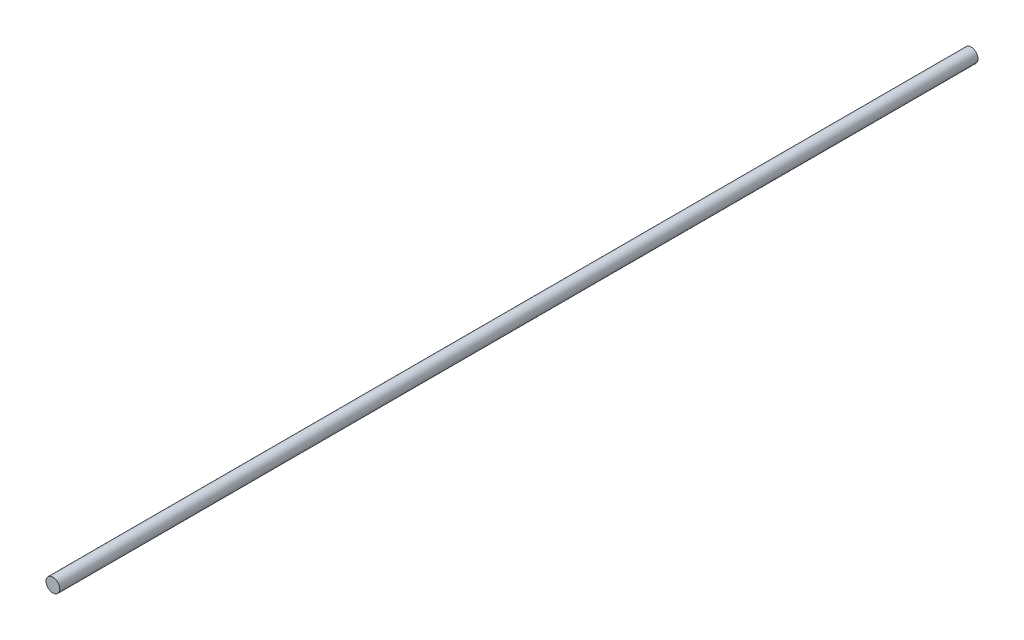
ISO-10303-21;
HEADER;
FILE_DESCRIPTION(('STEP AP214'),'2;1');
FILE_NAME('part.step','',(''),(''),'','','');
FILE_SCHEMA(('AUTOMOTIVE_DESIGN { 1 0 10303 214 1 1 1 1 }'));
ENDSEC;
DATA;
#1=APPLICATION_CONTEXT('core data for automotive mechanical design processes');
#2=APPLICATION_PROTOCOL_DEFINITION('international standard','automotive_design',2000,#1);
#3=PRODUCT_CONTEXT('',#1,'mechanical');
#4=PRODUCT('Part','Part','',(#3));
#5=PRODUCT_RELATED_PRODUCT_CATEGORY('part','',(#4));
#6=PRODUCT_DEFINITION_FORMATION('','',#4);
#7=PRODUCT_DEFINITION_CONTEXT('part definition',#1,'design');
#8=PRODUCT_DEFINITION('design','',#6,#7);
#9=PRODUCT_DEFINITION_SHAPE('','',#8);
#10=(LENGTH_UNIT() NAMED_UNIT(*) SI_UNIT(.MILLI.,.METRE.));
#11=(NAMED_UNIT(*) PLANE_ANGLE_UNIT() SI_UNIT($,.RADIAN.));
#12=(NAMED_UNIT(*) SI_UNIT($,.STERADIAN.) SOLID_ANGLE_UNIT());
#13=UNCERTAINTY_MEASURE_WITH_UNIT(LENGTH_MEASURE(1.E-05),#10,'distance_accuracy_value','');
#14=(GEOMETRIC_REPRESENTATION_CONTEXT(3) GLOBAL_UNCERTAINTY_ASSIGNED_CONTEXT((#13)) GLOBAL_UNIT_ASSIGNED_CONTEXT((#10,
#11,#12)) REPRESENTATION_CONTEXT('',''));
#15=CARTESIAN_POINT('',(0.,0.,0.));
#16=DIRECTION('',(0.,0.,1.));
#17=DIRECTION('',(1.,0.,0.));
#18=AXIS2_PLACEMENT_3D('',#15,#16,#17);
#19=CARTESIAN_POINT('',(0.,0.,635.));
#20=DIRECTION('',(0.,0.,-1.));
#21=DIRECTION('',(-1.,0.,0.));
#22=AXIS2_PLACEMENT_3D('',#19,#20,#21);
#23=CYLINDRICAL_SURFACE('',#22,4.7625);
#24=CARTESIAN_POINT('',(0.,0.,635.));
#25=DIRECTION('',(0.,0.,1.));
#26=DIRECTION('',(1.,0.,0.));
#27=AXIS2_PLACEMENT_3D('',#24,#25,#26);
#28=CIRCLE('',#27,4.7625);
#29=CARTESIAN_POINT('',(-4.7625,0.,635.));
#30=VERTEX_POINT('',#29);
#31=EDGE_CURVE('E10',#30,#30,#28,.T.);
#32=CARTESIAN_POINT('',(0.,0.,0.));
#33=DIRECTION('',(0.,0.,1.));
#34=DIRECTION('',(1.,0.,0.));
#35=AXIS2_PLACEMENT_3D('',#32,#33,#34);
#36=CIRCLE('',#35,4.7625);
#37=CARTESIAN_POINT('',(-4.7625,0.,-1.11022302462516E-13));
#38=VERTEX_POINT('',#37);
#39=EDGE_CURVE('E36',#38,#38,#36,.T.);
#40=CARTESIAN_POINT('',(-4.7625,0.,635.));
#41=CARTESIAN_POINT('',(-4.7625,0.,628.385416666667));
#42=CARTESIAN_POINT('',(-4.7625,0.,621.770833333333));
#43=CARTESIAN_POINT('',(-4.7625,0.,608.541666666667));
#44=CARTESIAN_POINT('',(-4.7625,0.,601.927083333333));
#45=CARTESIAN_POINT('',(-4.7625,0.,588.697916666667));
#46=CARTESIAN_POINT('',(-4.7625,0.,582.083333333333));
#47=CARTESIAN_POINT('',(-4.7625,0.,568.854166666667));
#48=CARTESIAN_POINT('',(-4.7625,0.,562.239583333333));
#49=CARTESIAN_POINT('',(-4.7625,0.,549.010416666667));
#50=CARTESIAN_POINT('',(-4.7625,0.,542.395833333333));
#51=CARTESIAN_POINT('',(-4.7625,0.,529.166666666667));
#52=CARTESIAN_POINT('',(-4.7625,0.,522.552083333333));
#53=CARTESIAN_POINT('',(-4.7625,0.,509.322916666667));
#54=CARTESIAN_POINT('',(-4.7625,0.,502.708333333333));
#55=CARTESIAN_POINT('',(-4.7625,0.,489.479166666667));
#56=CARTESIAN_POINT('',(-4.7625,0.,482.864583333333));
#57=CARTESIAN_POINT('',(-4.7625,0.,469.635416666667));
#58=CARTESIAN_POINT('',(-4.7625,0.,463.020833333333));
#59=CARTESIAN_POINT('',(-4.7625,0.,449.791666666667));
#60=CARTESIAN_POINT('',(-4.7625,0.,443.177083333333));
#61=CARTESIAN_POINT('',(-4.7625,0.,429.947916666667));
#62=CARTESIAN_POINT('',(-4.7625,0.,423.333333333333));
#63=CARTESIAN_POINT('',(-4.7625,0.,410.104166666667));
#64=CARTESIAN_POINT('',(-4.7625,0.,403.489583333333));
#65=CARTESIAN_POINT('',(-4.7625,0.,390.260416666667));
#66=CARTESIAN_POINT('',(-4.7625,0.,383.645833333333));
#67=CARTESIAN_POINT('',(-4.7625,0.,370.416666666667));
#68=CARTESIAN_POINT('',(-4.7625,0.,363.802083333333));
#69=CARTESIAN_POINT('',(-4.7625,0.,350.572916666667));
#70=CARTESIAN_POINT('',(-4.7625,0.,343.958333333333));
#71=CARTESIAN_POINT('',(-4.7625,0.,330.729166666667));
#72=CARTESIAN_POINT('',(-4.7625,0.,324.114583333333));
#73=CARTESIAN_POINT('',(-4.7625,0.,310.885416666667));
#74=CARTESIAN_POINT('',(-4.7625,0.,304.270833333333));
#75=CARTESIAN_POINT('',(-4.7625,0.,291.041666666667));
#76=CARTESIAN_POINT('',(-4.7625,0.,284.427083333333));
#77=CARTESIAN_POINT('',(-4.7625,0.,271.197916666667));
#78=CARTESIAN_POINT('',(-4.7625,0.,264.583333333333));
#79=CARTESIAN_POINT('',(-4.7625,0.,251.354166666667));
#80=CARTESIAN_POINT('',(-4.7625,0.,244.739583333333));
#81=CARTESIAN_POINT('',(-4.7625,0.,231.510416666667));
#82=CARTESIAN_POINT('',(-4.7625,0.,224.895833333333));
#83=CARTESIAN_POINT('',(-4.7625,0.,211.666666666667));
#84=CARTESIAN_POINT('',(-4.7625,0.,205.052083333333));
#85=CARTESIAN_POINT('',(-4.7625,0.,191.822916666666));
#86=CARTESIAN_POINT('',(-4.7625,0.,185.208333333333));
#87=CARTESIAN_POINT('',(-4.7625,0.,171.979166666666));
#88=CARTESIAN_POINT('',(-4.7625,0.,165.364583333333));
#89=CARTESIAN_POINT('',(-4.7625,0.,152.135416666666));
#90=CARTESIAN_POINT('',(-4.7625,0.,145.520833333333));
#91=CARTESIAN_POINT('',(-4.7625,0.,132.291666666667));
#92=CARTESIAN_POINT('',(-4.7625,0.,125.677083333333));
#93=CARTESIAN_POINT('',(-4.7625,0.,112.447916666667));
#94=CARTESIAN_POINT('',(-4.7625,0.,105.833333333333));
#95=CARTESIAN_POINT('',(-4.7625,0.,92.6041666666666));
#96=CARTESIAN_POINT('',(-4.7625,0.,85.9895833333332));
#97=CARTESIAN_POINT('',(-4.7625,0.,72.7604166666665));
#98=CARTESIAN_POINT('',(-4.7625,0.,66.1458333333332));
#99=CARTESIAN_POINT('',(-4.7625,0.,52.9166666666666));
#100=CARTESIAN_POINT('',(-4.7625,0.,46.3020833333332));
#101=CARTESIAN_POINT('',(-4.7625,0.,33.0729166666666));
#102=CARTESIAN_POINT('',(-4.7625,0.,26.4583333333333));
#103=CARTESIAN_POINT('',(-4.7625,0.,13.2291666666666));
#104=CARTESIAN_POINT('',(-4.7625,0.,6.61458333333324));
#105=CARTESIAN_POINT('',(-4.7625,0.,-1.11022302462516E-13));
#106=B_SPLINE_CURVE_WITH_KNOTS('',3,(#40,#41,#42,#43,#44,#45,#46,#47,#48,#49,#50,#51,#52,#53,
#54,#55,#56,#57,#58,#59,#60,#61,#62,#63,#64,#65,#66,#67,#68,#69,#70,#71,#72,#73,#74,#75,#76,#77,
#78,#79,#80,#81,#82,#83,#84,#85,#86,#87,#88,#89,#90,#91,#92,#93,#94,#95,#96,#97,#98,#99,#100,
#101,#102,#103,#104,#105),.UNSPECIFIED.,.F.,.F.,(4,2,2,2,2,2,2,2,2,2,2,2,2,2,2,2,2,2,2,2,2,2,2,
2,2,2,2,2,2,2,2,2,4),(0.,19.84375,39.6875000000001,59.53125,79.3750000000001,99.2187500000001,
119.0625,138.90625,158.75,178.59375,198.4375,218.28125,238.125,257.96875,277.8125,297.65625,
317.5,337.34375,357.1875,377.03125,396.875,416.71875,436.5625,456.40625,476.25,496.09375,
515.9375,535.78125,555.625,575.46875,595.3125,615.15625,635.),.UNSPECIFIED.);
#107=EDGE_CURVE('BSEAM30',#30,#38,#106,.T.);
#108=ORIENTED_EDGE('',*,*,#31,.F.);
#109=ORIENTED_EDGE('',*,*,#39,.T.);
#110=ORIENTED_EDGE('',*,*,#107,.T.);
#111=ORIENTED_EDGE('',*,*,#107,.F.);
#112=EDGE_LOOP('',(#108,#110,#109,#111));
#113=FACE_BOUND('',#112,.T.);
#114=ADVANCED_FACE('F30',(#113),#23,.T.);
#115=CARTESIAN_POINT('',(0.,0.,635.));
#116=DIRECTION('',(0.,0.,1.));
#117=DIRECTION('',(1.,0.,0.));
#118=AXIS2_PLACEMENT_3D('',#115,#116,#117);
#119=PLANE('',#118);
#120=ORIENTED_EDGE('',*,*,#31,.T.);
#121=EDGE_LOOP('',(#120));
#122=FACE_BOUND('',#121,.T.);
#123=ADVANCED_FACE('F45',(#122),#119,.T.);
#124=CARTESIAN_POINT('',(0.,0.,0.));
#125=DIRECTION('',(0.,0.,1.));
#126=DIRECTION('',(1.,0.,0.));
#127=AXIS2_PLACEMENT_3D('',#124,#125,#126);
#128=PLANE('',#127);
#129=ORIENTED_EDGE('',*,*,#39,.F.);
#130=EDGE_LOOP('',(#129));
#131=FACE_BOUND('',#130,.T.);
#132=ADVANCED_FACE('F43',(#131),#128,.F.);
#133=CLOSED_SHELL('',(#114,#123,#132));
#134=MANIFOLD_SOLID_BREP('B2',#133);
#135=ADVANCED_BREP_SHAPE_REPRESENTATION('',(#18,#134),#14);
#136=SHAPE_DEFINITION_REPRESENTATION(#9,#135);
ENDSEC;
END-ISO-10303-21;
